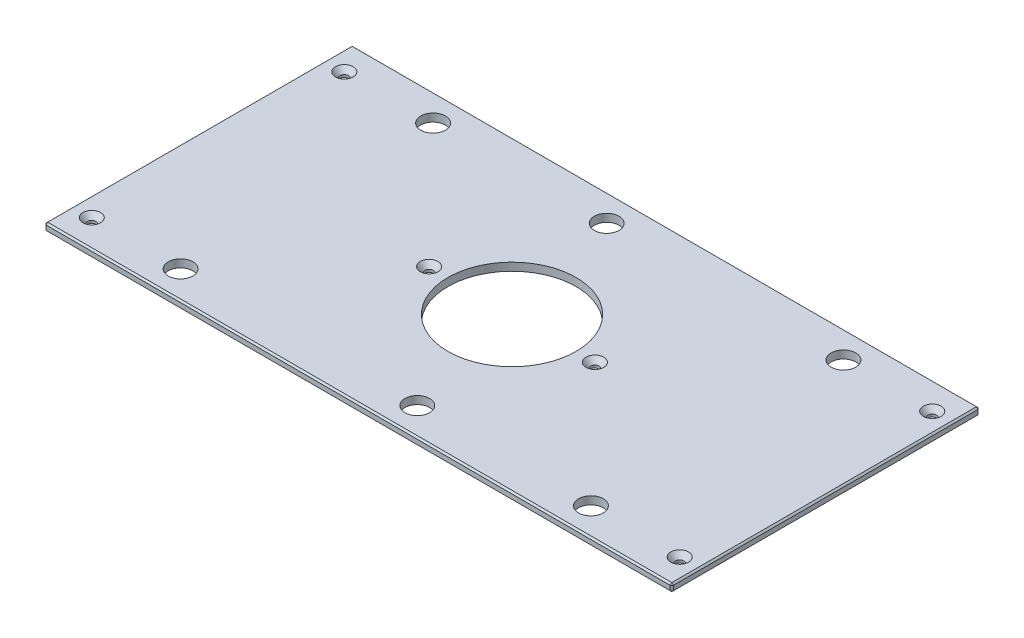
ISO-10303-21;
HEADER;
FILE_DESCRIPTION(('STEP AP214'),'2;1');
FILE_NAME('part.step','',(''),(''),'','','');
FILE_SCHEMA(('AUTOMOTIVE_DESIGN { 1 0 10303 214 1 1 1 1 }'));
ENDSEC;
DATA;
#1=APPLICATION_CONTEXT('core data for automotive mechanical design processes');
#2=APPLICATION_PROTOCOL_DEFINITION('international standard','automotive_design',2000,#1);
#3=PRODUCT_CONTEXT('',#1,'mechanical');
#4=PRODUCT('Part','Part','',(#3));
#5=PRODUCT_RELATED_PRODUCT_CATEGORY('part','',(#4));
#6=PRODUCT_DEFINITION_FORMATION('','',#4);
#7=PRODUCT_DEFINITION_CONTEXT('part definition',#1,'design');
#8=PRODUCT_DEFINITION('design','',#6,#7);
#9=PRODUCT_DEFINITION_SHAPE('','',#8);
#10=(LENGTH_UNIT() NAMED_UNIT(*) SI_UNIT(.MILLI.,.METRE.));
#11=(NAMED_UNIT(*) PLANE_ANGLE_UNIT() SI_UNIT($,.RADIAN.));
#12=(NAMED_UNIT(*) SI_UNIT($,.STERADIAN.) SOLID_ANGLE_UNIT());
#13=UNCERTAINTY_MEASURE_WITH_UNIT(LENGTH_MEASURE(1.E-05),#10,'distance_accuracy_value','');
#14=(GEOMETRIC_REPRESENTATION_CONTEXT(3) GLOBAL_UNCERTAINTY_ASSIGNED_CONTEXT((#13)) GLOBAL_UNIT_ASSIGNED_CONTEXT((#10,
#11,#12)) REPRESENTATION_CONTEXT('',''));
#15=CARTESIAN_POINT('',(0.,0.,0.));
#16=DIRECTION('',(0.,0.,1.));
#17=DIRECTION('',(1.,0.,0.));
#18=AXIS2_PLACEMENT_3D('',#15,#16,#17);
#19=CARTESIAN_POINT('',(-252.4125,6.35,-123.825));
#20=DIRECTION('',(1.,0.,0.));
#21=DIRECTION('',(0.,0.,-1.));
#22=AXIS2_PLACEMENT_3D('',#19,#20,#21);
#23=PLANE('',#22);
#24=DIRECTION('',(0.,0.,-1.));
#25=VECTOR('',#24,1.);
#26=CARTESIAN_POINT('',(-252.4125,5.07999999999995,-123.825));
#27=LINE('',#26,#25);
#28=CARTESIAN_POINT('',(-252.4125,5.07999999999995,122.555));
#29=VERTEX_POINT('',#28);
#30=CARTESIAN_POINT('',(-252.4125,5.07999999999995,-122.555));
#31=VERTEX_POINT('',#30);
#32=EDGE_CURVE('E134',#29,#31,#27,.T.);
#33=ORIENTED_EDGE('',*,*,#32,.T.);
#34=DIRECTION('',(0.,-1.,0.));
#35=VECTOR('',#34,1.);
#36=CARTESIAN_POINT('',(-252.4125,6.35,-122.555));
#37=LINE('',#36,#35);
#38=CARTESIAN_POINT('',(-252.4125,1.27000000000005,-122.555));
#39=VERTEX_POINT('',#38);
#40=EDGE_CURVE('E130',#31,#39,#37,.T.);
#41=ORIENTED_EDGE('',*,*,#40,.T.);
#42=DIRECTION('',(0.,0.,1.));
#43=VECTOR('',#42,1.);
#44=CARTESIAN_POINT('',(-252.4125,1.27000000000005,-123.825));
#45=LINE('',#44,#43);
#46=CARTESIAN_POINT('',(-252.4125,1.27000000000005,122.555));
#47=VERTEX_POINT('',#46);
#48=EDGE_CURVE('E125',#39,#47,#45,.T.);
#49=ORIENTED_EDGE('',*,*,#48,.T.);
#50=DIRECTION('',(0.,1.,0.));
#51=VECTOR('',#50,1.);
#52=CARTESIAN_POINT('',(-252.4125,6.35,122.555));
#53=LINE('',#52,#51);
#54=EDGE_CURVE('E127',#47,#29,#53,.T.);
#55=ORIENTED_EDGE('',*,*,#54,.T.);
#56=EDGE_LOOP('',(#33,#41,#49,#55));
#57=FACE_BOUND('',#56,.T.);
#58=ADVANCED_FACE('F34',(#57),#23,.F.);
#59=CARTESIAN_POINT('',(-252.4125,6.35,123.825));
#60=DIRECTION('',(0.,0.,-1.));
#61=DIRECTION('',(-1.,0.,0.));
#62=AXIS2_PLACEMENT_3D('',#59,#60,#61);
#63=PLANE('',#62);
#64=DIRECTION('',(1.,0.,0.));
#65=VECTOR('',#64,1.);
#66=CARTESIAN_POINT('',(-252.4125,1.27000000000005,123.825));
#67=LINE('',#66,#65);
#68=CARTESIAN_POINT('',(-251.1425,1.27000000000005,123.825));
#69=VERTEX_POINT('',#68);
#70=CARTESIAN_POINT('',(251.1425,1.27000000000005,123.825));
#71=VERTEX_POINT('',#70);
#72=EDGE_CURVE('E57',#69,#71,#67,.T.);
#73=ORIENTED_EDGE('',*,*,#72,.T.);
#74=DIRECTION('',(0.,1.,0.));
#75=VECTOR('',#74,1.);
#76=CARTESIAN_POINT('',(251.1425,6.35,123.825));
#77=LINE('',#76,#75);
#78=CARTESIAN_POINT('',(251.1425,5.07999999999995,123.825));
#79=VERTEX_POINT('',#78);
#80=EDGE_CURVE('E11',#71,#79,#77,.T.);
#81=ORIENTED_EDGE('',*,*,#80,.T.);
#82=DIRECTION('',(-1.,0.,0.));
#83=VECTOR('',#82,1.);
#84=CARTESIAN_POINT('',(-252.4125,5.07999999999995,123.825));
#85=LINE('',#84,#83);
#86=CARTESIAN_POINT('',(-251.1425,5.07999999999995,123.825));
#87=VERTEX_POINT('',#86);
#88=EDGE_CURVE('E43',#79,#87,#85,.T.);
#89=ORIENTED_EDGE('',*,*,#88,.T.);
#90=DIRECTION('',(0.,-1.,0.));
#91=VECTOR('',#90,1.);
#92=CARTESIAN_POINT('',(-251.1425,6.35,123.825));
#93=LINE('',#92,#91);
#94=EDGE_CURVE('E290',#87,#69,#93,.T.);
#95=ORIENTED_EDGE('',*,*,#94,.T.);
#96=EDGE_LOOP('',(#73,#81,#89,#95));
#97=FACE_BOUND('',#96,.T.);
#98=ADVANCED_FACE('F359',(#97),#63,.F.);
#99=CARTESIAN_POINT('',(252.4125,6.35,-123.825));
#100=DIRECTION('',(-1.,0.,0.));
#101=DIRECTION('',(0.,0.,1.));
#102=AXIS2_PLACEMENT_3D('',#99,#100,#101);
#103=PLANE('',#102);
#104=DIRECTION('',(0.,0.,-1.));
#105=VECTOR('',#104,1.);
#106=CARTESIAN_POINT('',(252.4125,1.27000000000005,-123.825));
#107=LINE('',#106,#105);
#108=CARTESIAN_POINT('',(252.4125,1.27000000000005,122.555));
#109=VERTEX_POINT('',#108);
#110=CARTESIAN_POINT('',(252.4125,1.27000000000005,-122.555));
#111=VERTEX_POINT('',#110);
#112=EDGE_CURVE('E285',#109,#111,#107,.T.);
#113=ORIENTED_EDGE('',*,*,#112,.T.);
#114=DIRECTION('',(0.,1.,0.));
#115=VECTOR('',#114,1.);
#116=CARTESIAN_POINT('',(252.4125,6.35,-122.555));
#117=LINE('',#116,#115);
#118=CARTESIAN_POINT('',(252.4125,5.07999999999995,-122.555));
#119=VERTEX_POINT('',#118);
#120=EDGE_CURVE('E287',#111,#119,#117,.T.);
#121=ORIENTED_EDGE('',*,*,#120,.T.);
#122=DIRECTION('',(0.,0.,1.));
#123=VECTOR('',#122,1.);
#124=CARTESIAN_POINT('',(252.4125,5.07999999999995,123.825));
#125=LINE('',#124,#123);
#126=CARTESIAN_POINT('',(252.4125,5.07999999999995,122.555));
#127=VERTEX_POINT('',#126);
#128=EDGE_CURVE('E283',#119,#127,#125,.T.);
#129=ORIENTED_EDGE('',*,*,#128,.T.);
#130=DIRECTION('',(0.,-1.,0.));
#131=VECTOR('',#130,1.);
#132=CARTESIAN_POINT('',(252.4125,6.35,122.555));
#133=LINE('',#132,#131);
#134=EDGE_CURVE('E281',#127,#109,#133,.T.);
#135=ORIENTED_EDGE('',*,*,#134,.T.);
#136=EDGE_LOOP('',(#113,#121,#129,#135));
#137=FACE_BOUND('',#136,.T.);
#138=ADVANCED_FACE('F346',(#137),#103,.F.);
#139=CARTESIAN_POINT('',(-252.4125,6.35,-123.825));
#140=DIRECTION('',(0.,0.,1.));
#141=DIRECTION('',(1.,0.,0.));
#142=AXIS2_PLACEMENT_3D('',#139,#140,#141);
#143=PLANE('',#142);
#144=DIRECTION('',(-1.,0.,0.));
#145=VECTOR('',#144,1.);
#146=CARTESIAN_POINT('',(-252.4125,1.27000000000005,-123.825));
#147=LINE('',#146,#145);
#148=CARTESIAN_POINT('',(251.1425,1.27000000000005,-123.825));
#149=VERTEX_POINT('',#148);
#150=CARTESIAN_POINT('',(-251.1425,1.27000000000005,-123.825));
#151=VERTEX_POINT('',#150);
#152=EDGE_CURVE('E257',#149,#151,#147,.T.);
#153=ORIENTED_EDGE('',*,*,#152,.T.);
#154=DIRECTION('',(0.,1.,0.));
#155=VECTOR('',#154,1.);
#156=CARTESIAN_POINT('',(-251.1425,6.35,-123.825));
#157=LINE('',#156,#155);
#158=CARTESIAN_POINT('',(-251.1425,5.07999999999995,-123.825));
#159=VERTEX_POINT('',#158);
#160=EDGE_CURVE('E261',#151,#159,#157,.T.);
#161=ORIENTED_EDGE('',*,*,#160,.T.);
#162=DIRECTION('',(1.,0.,0.));
#163=VECTOR('',#162,1.);
#164=CARTESIAN_POINT('',(252.4125,5.07999999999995,-123.825));
#165=LINE('',#164,#163);
#166=CARTESIAN_POINT('',(251.1425,5.07999999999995,-123.825));
#167=VERTEX_POINT('',#166);
#168=EDGE_CURVE('E259',#159,#167,#165,.T.);
#169=ORIENTED_EDGE('',*,*,#168,.T.);
#170=DIRECTION('',(0.,-1.,0.));
#171=VECTOR('',#170,1.);
#172=CARTESIAN_POINT('',(251.1425,6.35,-123.825));
#173=LINE('',#172,#171);
#174=EDGE_CURVE('E255',#167,#149,#173,.T.);
#175=ORIENTED_EDGE('',*,*,#174,.T.);
#176=EDGE_LOOP('',(#153,#161,#169,#175));
#177=FACE_BOUND('',#176,.T.);
#178=ADVANCED_FACE('F320',(#177),#143,.F.);
#179=CARTESIAN_POINT('',(0.,6.35,0.));
#180=DIRECTION('',(0.,1.,0.));
#181=DIRECTION('',(0.,0.,1.));
#182=AXIS2_PLACEMENT_3D('',#179,#180,#181);
#183=PLANE('',#182);
#184=CARTESIAN_POINT('',(236.5375,6.35,-101.6));
#185=DIRECTION('',(0.,1.,0.));
#186=DIRECTION('',(0.,0.,1.));
#187=AXIS2_PLACEMENT_3D('',#184,#185,#186);
#188=CIRCLE('',#187,7.13739999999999);
#189=CARTESIAN_POINT('',(236.5375,6.35,-94.4626));
#190=VERTEX_POINT('',#189);
#191=EDGE_CURVE('E783',#190,#190,#188,.T.);
#192=ORIENTED_EDGE('',*,*,#191,.F.);
#193=EDGE_LOOP('',(#192));
#194=FACE_BOUND('',#193,.T.);
#195=CARTESIAN_POINT('',(236.5375,6.35,101.6));
#196=DIRECTION('',(0.,1.,0.));
#197=DIRECTION('',(0.,0.,1.));
#198=AXIS2_PLACEMENT_3D('',#195,#196,#197);
#199=CIRCLE('',#198,7.13739999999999);
#200=CARTESIAN_POINT('',(236.5375,6.35,108.7374));
#201=VERTEX_POINT('',#200);
#202=EDGE_CURVE('E787',#201,#201,#199,.T.);
#203=ORIENTED_EDGE('',*,*,#202,.F.);
#204=EDGE_LOOP('',(#203));
#205=FACE_BOUND('',#204,.T.);
#206=CARTESIAN_POINT('',(-236.5375,6.35,101.6));
#207=DIRECTION('',(0.,1.,0.));
#208=DIRECTION('',(0.,0.,1.));
#209=AXIS2_PLACEMENT_3D('',#206,#207,#208);
#210=CIRCLE('',#209,7.13739999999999);
#211=CARTESIAN_POINT('',(-236.5375,6.35,108.7374));
#212=VERTEX_POINT('',#211);
#213=EDGE_CURVE('E791',#212,#212,#210,.T.);
#214=ORIENTED_EDGE('',*,*,#213,.F.);
#215=EDGE_LOOP('',(#214));
#216=FACE_BOUND('',#215,.T.);
#217=CARTESIAN_POINT('',(-66.675,6.35,0.));
#218=DIRECTION('',(0.,1.,0.));
#219=DIRECTION('',(0.,0.,1.));
#220=AXIS2_PLACEMENT_3D('',#217,#218,#219);
#221=CIRCLE('',#220,7.1374);
#222=CARTESIAN_POINT('',(-66.675,6.35,7.1374));
#223=VERTEX_POINT('',#222);
#224=EDGE_CURVE('E795',#223,#223,#221,.T.);
#225=ORIENTED_EDGE('',*,*,#224,.F.);
#226=EDGE_LOOP('',(#225));
#227=FACE_BOUND('',#226,.T.);
#228=CARTESIAN_POINT('',(66.675,6.35,0.));
#229=DIRECTION('',(0.,1.,0.));
#230=DIRECTION('',(0.,0.,1.));
#231=AXIS2_PLACEMENT_3D('',#228,#229,#230);
#232=CIRCLE('',#231,7.1374);
#233=CARTESIAN_POINT('',(66.675,6.35,7.1374));
#234=VERTEX_POINT('',#233);
#235=EDGE_CURVE('E799',#234,#234,#232,.T.);
#236=ORIENTED_EDGE('',*,*,#235,.F.);
#237=EDGE_LOOP('',(#236));
#238=FACE_BOUND('',#237,.T.);
#239=CARTESIAN_POINT('',(-236.5375,6.35,-101.6));
#240=DIRECTION('',(0.,1.,0.));
#241=DIRECTION('',(0.,0.,1.));
#242=AXIS2_PLACEMENT_3D('',#239,#240,#241);
#243=CIRCLE('',#242,7.13739999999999);
#244=CARTESIAN_POINT('',(-236.5375,6.35,-94.4626));
#245=VERTEX_POINT('',#244);
#246=EDGE_CURVE('E802',#245,#245,#243,.T.);
#247=ORIENTED_EDGE('',*,*,#246,.F.);
#248=EDGE_LOOP('',(#247));
#249=FACE_BOUND('',#248,.T.);
#250=DIRECTION('',(0.,0.,-1.));
#251=VECTOR('',#250,1.);
#252=CARTESIAN_POINT('',(251.1425,6.35,-123.825));
#253=LINE('',#252,#251);
#254=CARTESIAN_POINT('',(251.1425,6.35,122.555));
#255=VERTEX_POINT('',#254);
#256=CARTESIAN_POINT('',(251.1425,6.35,-122.555));
#257=VERTEX_POINT('',#256);
#258=EDGE_CURVE('E268',#255,#257,#253,.T.);
#259=ORIENTED_EDGE('',*,*,#258,.T.);
#260=DIRECTION('',(-1.,0.,0.));
#261=VECTOR('',#260,1.);
#262=CARTESIAN_POINT('',(-252.4125,6.35,-122.555));
#263=LINE('',#262,#261);
#264=CARTESIAN_POINT('',(-251.1425,6.35,-122.555));
#265=VERTEX_POINT('',#264);
#266=EDGE_CURVE('E270',#257,#265,#263,.T.);
#267=ORIENTED_EDGE('',*,*,#266,.T.);
#268=DIRECTION('',(0.,0.,1.));
#269=VECTOR('',#268,1.);
#270=CARTESIAN_POINT('',(-251.1425,6.35,123.825));
#271=LINE('',#270,#269);
#272=CARTESIAN_POINT('',(-251.1425,6.35,122.555));
#273=VERTEX_POINT('',#272);
#274=EDGE_CURVE('E266',#265,#273,#271,.T.);
#275=ORIENTED_EDGE('',*,*,#274,.T.);
#276=DIRECTION('',(1.,0.,0.));
#277=VECTOR('',#276,1.);
#278=CARTESIAN_POINT('',(252.4125,6.35,122.555));
#279=LINE('',#278,#277);
#280=EDGE_CURVE('E264',#273,#255,#279,.T.);
#281=ORIENTED_EDGE('',*,*,#280,.T.);
#282=EDGE_LOOP('',(#259,#267,#275,#281));
#283=FACE_BOUND('',#282,.T.);
#284=CARTESIAN_POINT('',(165.1,6.35,-101.6));
#285=DIRECTION('',(0.,1.,0.));
#286=DIRECTION('',(0.,0.,1.));
#287=AXIS2_PLACEMENT_3D('',#284,#285,#286);
#288=CIRCLE('',#287,9.921875);
#289=CARTESIAN_POINT('',(165.1,6.35,-91.678125));
#290=VERTEX_POINT('',#289);
#291=EDGE_CURVE('E203',#290,#290,#288,.T.);
#292=ORIENTED_EDGE('',*,*,#291,.F.);
#293=EDGE_LOOP('',(#292));
#294=FACE_BOUND('',#293,.T.);
#295=CARTESIAN_POINT('',(-165.1,6.35,-101.6));
#296=DIRECTION('',(0.,1.,0.));
#297=DIRECTION('',(0.,0.,1.));
#298=AXIS2_PLACEMENT_3D('',#295,#296,#297);
#299=CIRCLE('',#298,9.921875);
#300=CARTESIAN_POINT('',(-165.1,6.35,-91.678125));
#301=VERTEX_POINT('',#300);
#302=EDGE_CURVE('E213',#301,#301,#299,.T.);
#303=ORIENTED_EDGE('',*,*,#302,.F.);
#304=EDGE_LOOP('',(#303));
#305=FACE_BOUND('',#304,.T.);
#306=CARTESIAN_POINT('',(165.1,6.35,101.6));
#307=DIRECTION('',(0.,1.,0.));
#308=DIRECTION('',(0.,0.,1.));
#309=AXIS2_PLACEMENT_3D('',#306,#307,#308);
#310=CIRCLE('',#309,9.921875);
#311=CARTESIAN_POINT('',(165.1,6.35,111.521875));
#312=VERTEX_POINT('',#311);
#313=EDGE_CURVE('E224',#312,#312,#310,.T.);
#314=ORIENTED_EDGE('',*,*,#313,.F.);
#315=EDGE_LOOP('',(#314));
#316=FACE_BOUND('',#315,.T.);
#317=CARTESIAN_POINT('',(-165.1,6.35,101.6));
#318=DIRECTION('',(0.,1.,0.));
#319=DIRECTION('',(0.,0.,1.));
#320=AXIS2_PLACEMENT_3D('',#317,#318,#319);
#321=CIRCLE('',#320,9.921875);
#322=CARTESIAN_POINT('',(-165.1,6.35,111.521875));
#323=VERTEX_POINT('',#322);
#324=EDGE_CURVE('E230',#323,#323,#321,.T.);
#325=ORIENTED_EDGE('',*,*,#324,.F.);
#326=EDGE_LOOP('',(#325));
#327=FACE_BOUND('',#326,.T.);
#328=CARTESIAN_POINT('',(-25.4,6.35,-101.6));
#329=DIRECTION('',(0.,1.,0.));
#330=DIRECTION('',(0.,0.,1.));
#331=AXIS2_PLACEMENT_3D('',#328,#329,#330);
#332=CIRCLE('',#331,9.921875);
#333=CARTESIAN_POINT('',(-25.4,6.35,-91.678125));
#334=VERTEX_POINT('',#333);
#335=EDGE_CURVE('E236',#334,#334,#332,.T.);
#336=ORIENTED_EDGE('',*,*,#335,.F.);
#337=EDGE_LOOP('',(#336));
#338=FACE_BOUND('',#337,.T.);
#339=CARTESIAN_POINT('',(25.4,6.35,101.6));
#340=DIRECTION('',(0.,1.,0.));
#341=DIRECTION('',(0.,0.,1.));
#342=AXIS2_PLACEMENT_3D('',#339,#340,#341);
#343=CIRCLE('',#342,9.921875);
#344=CARTESIAN_POINT('',(25.4,6.35,111.521875));
#345=VERTEX_POINT('',#344);
#346=EDGE_CURVE('E242',#345,#345,#343,.T.);
#347=ORIENTED_EDGE('',*,*,#346,.F.);
#348=EDGE_LOOP('',(#347));
#349=FACE_BOUND('',#348,.T.);
#350=CARTESIAN_POINT('',(0.,6.35,0.));
#351=DIRECTION('',(0.,1.,0.));
#352=DIRECTION('',(0.,0.,1.));
#353=AXIS2_PLACEMENT_3D('',#350,#351,#352);
#354=CIRCLE('',#353,51.562);
#355=CARTESIAN_POINT('',(0.,6.35,51.562));
#356=VERTEX_POINT('',#355);
#357=EDGE_CURVE('E248',#356,#356,#354,.T.);
#358=ORIENTED_EDGE('',*,*,#357,.F.);
#359=EDGE_LOOP('',(#358));
#360=FACE_BOUND('',#359,.T.);
#361=ADVANCED_FACE('F368',(#194,#205,#216,#227,#238,#249,#283,#294,#305,#316,#327,#338,#349,
#360),#183,.T.);
#362=CARTESIAN_POINT('',(0.,0.,0.));
#363=DIRECTION('',(0.,1.,0.));
#364=DIRECTION('',(0.,0.,1.));
#365=AXIS2_PLACEMENT_3D('',#362,#363,#364);
#366=PLANE('',#365);
#367=CARTESIAN_POINT('',(236.5375,0.,-101.6));
#368=DIRECTION('',(0.,1.,0.));
#369=DIRECTION('',(0.,0.,1.));
#370=AXIS2_PLACEMENT_3D('',#367,#368,#369);
#371=CIRCLE('',#370,3.3782);
#372=CARTESIAN_POINT('',(236.5375,0.,-98.2218));
#373=VERTEX_POINT('',#372);
#374=EDGE_CURVE('E836',#373,#373,#371,.T.);
#375=ORIENTED_EDGE('',*,*,#374,.T.);
#376=EDGE_LOOP('',(#375));
#377=FACE_BOUND('',#376,.T.);
#378=CARTESIAN_POINT('',(236.5375,0.,101.6));
#379=DIRECTION('',(0.,1.,0.));
#380=DIRECTION('',(0.,0.,1.));
#381=AXIS2_PLACEMENT_3D('',#378,#379,#380);
#382=CIRCLE('',#381,3.3782);
#383=CARTESIAN_POINT('',(236.5375,0.,104.9782));
#384=VERTEX_POINT('',#383);
#385=EDGE_CURVE('E829',#384,#384,#382,.T.);
#386=ORIENTED_EDGE('',*,*,#385,.T.);
#387=EDGE_LOOP('',(#386));
#388=FACE_BOUND('',#387,.T.);
#389=CARTESIAN_POINT('',(-236.5375,0.,101.6));
#390=DIRECTION('',(0.,1.,0.));
#391=DIRECTION('',(0.,0.,1.));
#392=AXIS2_PLACEMENT_3D('',#389,#390,#391);
#393=CIRCLE('',#392,3.3782);
#394=CARTESIAN_POINT('',(-236.5375,0.,104.9782));
#395=VERTEX_POINT('',#394);
#396=EDGE_CURVE('E822',#395,#395,#393,.T.);
#397=ORIENTED_EDGE('',*,*,#396,.T.);
#398=EDGE_LOOP('',(#397));
#399=FACE_BOUND('',#398,.T.);
#400=CARTESIAN_POINT('',(-66.675,0.,0.));
#401=DIRECTION('',(0.,1.,0.));
#402=DIRECTION('',(0.,0.,1.));
#403=AXIS2_PLACEMENT_3D('',#400,#401,#402);
#404=CIRCLE('',#403,3.3782);
#405=CARTESIAN_POINT('',(-66.675,0.,3.3782));
#406=VERTEX_POINT('',#405);
#407=EDGE_CURVE('E815',#406,#406,#404,.T.);
#408=ORIENTED_EDGE('',*,*,#407,.T.);
#409=EDGE_LOOP('',(#408));
#410=FACE_BOUND('',#409,.T.);
#411=CARTESIAN_POINT('',(66.675,0.,0.));
#412=DIRECTION('',(0.,1.,0.));
#413=DIRECTION('',(0.,0.,1.));
#414=AXIS2_PLACEMENT_3D('',#411,#412,#413);
#415=CIRCLE('',#414,3.3782);
#416=CARTESIAN_POINT('',(66.675,0.,3.3782));
#417=VERTEX_POINT('',#416);
#418=EDGE_CURVE('E805',#417,#417,#415,.T.);
#419=ORIENTED_EDGE('',*,*,#418,.T.);
#420=EDGE_LOOP('',(#419));
#421=FACE_BOUND('',#420,.T.);
#422=CARTESIAN_POINT('',(-236.5375,0.,-101.6));
#423=DIRECTION('',(0.,1.,0.));
#424=DIRECTION('',(0.,0.,1.));
#425=AXIS2_PLACEMENT_3D('',#422,#423,#424);
#426=CIRCLE('',#425,3.3782);
#427=CARTESIAN_POINT('',(-236.5375,0.,-98.2218));
#428=VERTEX_POINT('',#427);
#429=EDGE_CURVE('E216',#428,#428,#426,.T.);
#430=ORIENTED_EDGE('',*,*,#429,.T.);
#431=EDGE_LOOP('',(#430));
#432=FACE_BOUND('',#431,.T.);
#433=DIRECTION('',(0.,0.,-1.));
#434=VECTOR('',#433,1.);
#435=CARTESIAN_POINT('',(-251.1425,0.,0.));
#436=LINE('',#435,#434);
#437=CARTESIAN_POINT('',(-251.1425,0.,122.555));
#438=VERTEX_POINT('',#437);
#439=CARTESIAN_POINT('',(-251.1425,0.,-122.555));
#440=VERTEX_POINT('',#439);
#441=EDGE_CURVE('E157',#438,#440,#436,.T.);
#442=ORIENTED_EDGE('',*,*,#441,.T.);
#443=DIRECTION('',(1.,0.,0.));
#444=VECTOR('',#443,1.);
#445=CARTESIAN_POINT('',(0.,0.,-122.555));
#446=LINE('',#445,#444);
#447=CARTESIAN_POINT('',(251.1425,0.,-122.555));
#448=VERTEX_POINT('',#447);
#449=EDGE_CURVE('E278',#440,#448,#446,.T.);
#450=ORIENTED_EDGE('',*,*,#449,.T.);
#451=DIRECTION('',(0.,0.,1.));
#452=VECTOR('',#451,1.);
#453=CARTESIAN_POINT('',(251.1425,0.,0.));
#454=LINE('',#453,#452);
#455=CARTESIAN_POINT('',(251.1425,0.,122.555));
#456=VERTEX_POINT('',#455);
#457=EDGE_CURVE('E276',#448,#456,#454,.T.);
#458=ORIENTED_EDGE('',*,*,#457,.T.);
#459=DIRECTION('',(-1.,0.,0.));
#460=VECTOR('',#459,1.);
#461=CARTESIAN_POINT('',(0.,0.,122.555));
#462=LINE('',#461,#460);
#463=EDGE_CURVE('E273',#456,#438,#462,.T.);
#464=ORIENTED_EDGE('',*,*,#463,.T.);
#465=EDGE_LOOP('',(#442,#450,#458,#464));
#466=FACE_BOUND('',#465,.T.);
#467=CARTESIAN_POINT('',(165.1,0.,-101.6));
#468=DIRECTION('',(0.,1.,0.));
#469=DIRECTION('',(0.,0.,1.));
#470=AXIS2_PLACEMENT_3D('',#467,#468,#469);
#471=CIRCLE('',#470,9.921875);
#472=CARTESIAN_POINT('',(165.1,0.,-91.678125));
#473=VERTEX_POINT('',#472);
#474=EDGE_CURVE('E208',#473,#473,#471,.T.);
#475=ORIENTED_EDGE('',*,*,#474,.T.);
#476=EDGE_LOOP('',(#475));
#477=FACE_BOUND('',#476,.T.);
#478=CARTESIAN_POINT('',(-165.1,0.,-101.6));
#479=DIRECTION('',(0.,1.,0.));
#480=DIRECTION('',(0.,0.,1.));
#481=AXIS2_PLACEMENT_3D('',#478,#479,#480);
#482=CIRCLE('',#481,9.921875);
#483=CARTESIAN_POINT('',(-165.1,0.,-91.678125));
#484=VERTEX_POINT('',#483);
#485=EDGE_CURVE('E221',#484,#484,#482,.T.);
#486=ORIENTED_EDGE('',*,*,#485,.T.);
#487=EDGE_LOOP('',(#486));
#488=FACE_BOUND('',#487,.T.);
#489=CARTESIAN_POINT('',(165.1,0.,101.6));
#490=DIRECTION('',(0.,1.,0.));
#491=DIRECTION('',(0.,0.,1.));
#492=AXIS2_PLACEMENT_3D('',#489,#490,#491);
#493=CIRCLE('',#492,9.921875);
#494=CARTESIAN_POINT('',(165.1,0.,111.521875));
#495=VERTEX_POINT('',#494);
#496=EDGE_CURVE('E227',#495,#495,#493,.T.);
#497=ORIENTED_EDGE('',*,*,#496,.T.);
#498=EDGE_LOOP('',(#497));
#499=FACE_BOUND('',#498,.T.);
#500=CARTESIAN_POINT('',(-165.1,0.,101.6));
#501=DIRECTION('',(0.,1.,0.));
#502=DIRECTION('',(0.,0.,1.));
#503=AXIS2_PLACEMENT_3D('',#500,#501,#502);
#504=CIRCLE('',#503,9.921875);
#505=CARTESIAN_POINT('',(-165.1,0.,111.521875));
#506=VERTEX_POINT('',#505);
#507=EDGE_CURVE('E233',#506,#506,#504,.T.);
#508=ORIENTED_EDGE('',*,*,#507,.T.);
#509=EDGE_LOOP('',(#508));
#510=FACE_BOUND('',#509,.T.);
#511=CARTESIAN_POINT('',(-25.4,0.,-101.6));
#512=DIRECTION('',(0.,1.,0.));
#513=DIRECTION('',(0.,0.,1.));
#514=AXIS2_PLACEMENT_3D('',#511,#512,#513);
#515=CIRCLE('',#514,9.921875);
#516=CARTESIAN_POINT('',(-25.4,0.,-91.678125));
#517=VERTEX_POINT('',#516);
#518=EDGE_CURVE('E239',#517,#517,#515,.T.);
#519=ORIENTED_EDGE('',*,*,#518,.T.);
#520=EDGE_LOOP('',(#519));
#521=FACE_BOUND('',#520,.T.);
#522=CARTESIAN_POINT('',(25.4,0.,101.6));
#523=DIRECTION('',(0.,1.,0.));
#524=DIRECTION('',(0.,0.,1.));
#525=AXIS2_PLACEMENT_3D('',#522,#523,#524);
#526=CIRCLE('',#525,9.921875);
#527=CARTESIAN_POINT('',(25.4,0.,111.521875));
#528=VERTEX_POINT('',#527);
#529=EDGE_CURVE('E245',#528,#528,#526,.T.);
#530=ORIENTED_EDGE('',*,*,#529,.T.);
#531=EDGE_LOOP('',(#530));
#532=FACE_BOUND('',#531,.T.);
#533=CARTESIAN_POINT('',(0.,0.,0.));
#534=DIRECTION('',(0.,1.,0.));
#535=DIRECTION('',(0.,0.,1.));
#536=AXIS2_PLACEMENT_3D('',#533,#534,#535);
#537=CIRCLE('',#536,51.562);
#538=CARTESIAN_POINT('',(0.,0.,51.562));
#539=VERTEX_POINT('',#538);
#540=EDGE_CURVE('E146',#539,#539,#537,.T.);
#541=ORIENTED_EDGE('',*,*,#540,.T.);
#542=EDGE_LOOP('',(#541));
#543=FACE_BOUND('',#542,.T.);
#544=ADVANCED_FACE('F333',(#377,#388,#399,#410,#421,#432,#466,#477,#488,#499,#510,#521,#532,
#543),#366,.F.);
#545=CARTESIAN_POINT('',(0.,0.,0.));
#546=DIRECTION('',(0.,1.,0.));
#547=DIRECTION('',(0.,0.,1.));
#548=AXIS2_PLACEMENT_3D('',#545,#546,#547);
#549=CYLINDRICAL_SURFACE('',#548,51.562);
#550=ORIENTED_EDGE('',*,*,#540,.F.);
#551=EDGE_LOOP('',(#550));
#552=FACE_BOUND('',#551,.T.);
#553=ORIENTED_EDGE('',*,*,#357,.T.);
#554=EDGE_LOOP('',(#553));
#555=FACE_BOUND('',#554,.T.);
#556=ADVANCED_FACE('F720',(#552,#555),#549,.F.);
#557=CARTESIAN_POINT('',(25.4,6.35,101.6));
#558=DIRECTION('',(0.,1.,0.));
#559=DIRECTION('',(0.,0.,1.));
#560=AXIS2_PLACEMENT_3D('',#557,#558,#559);
#561=CYLINDRICAL_SURFACE('',#560,9.921875);
#562=ORIENTED_EDGE('',*,*,#529,.F.);
#563=EDGE_LOOP('',(#562));
#564=FACE_BOUND('',#563,.T.);
#565=ORIENTED_EDGE('',*,*,#346,.T.);
#566=EDGE_LOOP('',(#565));
#567=FACE_BOUND('',#566,.T.);
#568=ADVANCED_FACE('F711',(#564,#567),#561,.F.);
#569=CARTESIAN_POINT('',(-25.4,6.35,-101.6));
#570=DIRECTION('',(0.,1.,0.));
#571=DIRECTION('',(0.,0.,1.));
#572=AXIS2_PLACEMENT_3D('',#569,#570,#571);
#573=CYLINDRICAL_SURFACE('',#572,9.921875);
#574=ORIENTED_EDGE('',*,*,#518,.F.);
#575=EDGE_LOOP('',(#574));
#576=FACE_BOUND('',#575,.T.);
#577=ORIENTED_EDGE('',*,*,#335,.T.);
#578=EDGE_LOOP('',(#577));
#579=FACE_BOUND('',#578,.T.);
#580=ADVANCED_FACE('F702',(#576,#579),#573,.F.);
#581=CARTESIAN_POINT('',(-165.1,6.35,101.6));
#582=DIRECTION('',(0.,1.,0.));
#583=DIRECTION('',(0.,0.,1.));
#584=AXIS2_PLACEMENT_3D('',#581,#582,#583);
#585=CYLINDRICAL_SURFACE('',#584,9.921875);
#586=ORIENTED_EDGE('',*,*,#507,.F.);
#587=EDGE_LOOP('',(#586));
#588=FACE_BOUND('',#587,.T.);
#589=ORIENTED_EDGE('',*,*,#324,.T.);
#590=EDGE_LOOP('',(#589));
#591=FACE_BOUND('',#590,.T.);
#592=ADVANCED_FACE('F693',(#588,#591),#585,.F.);
#593=CARTESIAN_POINT('',(165.1,6.35,101.6));
#594=DIRECTION('',(0.,1.,0.));
#595=DIRECTION('',(0.,0.,1.));
#596=AXIS2_PLACEMENT_3D('',#593,#594,#595);
#597=CYLINDRICAL_SURFACE('',#596,9.921875);
#598=ORIENTED_EDGE('',*,*,#496,.F.);
#599=EDGE_LOOP('',(#598));
#600=FACE_BOUND('',#599,.T.);
#601=ORIENTED_EDGE('',*,*,#313,.T.);
#602=EDGE_LOOP('',(#601));
#603=FACE_BOUND('',#602,.T.);
#604=ADVANCED_FACE('F684',(#600,#603),#597,.F.);
#605=CARTESIAN_POINT('',(-165.1,6.35,-101.6));
#606=DIRECTION('',(0.,1.,0.));
#607=DIRECTION('',(0.,0.,1.));
#608=AXIS2_PLACEMENT_3D('',#605,#606,#607);
#609=CYLINDRICAL_SURFACE('',#608,9.921875);
#610=ORIENTED_EDGE('',*,*,#485,.F.);
#611=EDGE_LOOP('',(#610));
#612=FACE_BOUND('',#611,.T.);
#613=ORIENTED_EDGE('',*,*,#302,.T.);
#614=EDGE_LOOP('',(#613));
#615=FACE_BOUND('',#614,.T.);
#616=ADVANCED_FACE('F674',(#612,#615),#609,.F.);
#617=CARTESIAN_POINT('',(165.1,6.35,-101.6));
#618=DIRECTION('',(0.,1.,0.));
#619=DIRECTION('',(0.,0.,1.));
#620=AXIS2_PLACEMENT_3D('',#617,#618,#619);
#621=CYLINDRICAL_SURFACE('',#620,9.921875);
#622=ORIENTED_EDGE('',*,*,#474,.F.);
#623=EDGE_LOOP('',(#622));
#624=FACE_BOUND('',#623,.T.);
#625=ORIENTED_EDGE('',*,*,#291,.T.);
#626=EDGE_LOOP('',(#625));
#627=FACE_BOUND('',#626,.T.);
#628=ADVANCED_FACE('F377',(#624,#627),#621,.F.);
#629=CARTESIAN_POINT('',(252.4125,6.35,122.555));
#630=DIRECTION('',(-0.707106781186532,0.,-0.707106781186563));
#631=DIRECTION('',(0.,-1.,0.));
#632=AXIS2_PLACEMENT_3D('',#629,#630,#631);
#633=PLANE('',#632);
#634=DIRECTION('',(-0.707106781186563,0.,0.707106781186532));
#635=VECTOR('',#634,1.);
#636=CARTESIAN_POINT('',(252.4125,5.07999999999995,122.555));
#637=LINE('',#636,#635);
#638=EDGE_CURVE('E38',#79,#127,#637,.F.);
#639=ORIENTED_EDGE('',*,*,#638,.F.);
#640=ORIENTED_EDGE('',*,*,#80,.F.);
#641=DIRECTION('',(0.707106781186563,0.,-0.707106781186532));
#642=VECTOR('',#641,1.);
#643=CARTESIAN_POINT('',(251.7775,1.27000000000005,123.19));
#644=LINE('',#643,#642);
#645=EDGE_CURVE('E196',#109,#71,#644,.F.);
#646=ORIENTED_EDGE('',*,*,#645,.F.);
#647=ORIENTED_EDGE('',*,*,#134,.F.);
#648=EDGE_LOOP('',(#639,#640,#646,#647));
#649=FACE_BOUND('',#648,.T.);
#650=ADVANCED_FACE('F36',(#649),#633,.F.);
#651=CARTESIAN_POINT('',(252.4125,5.07999999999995,122.555));
#652=DIRECTION('',(0.577350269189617,0.577350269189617,0.577350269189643));
#653=DIRECTION('',(0.707106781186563,0.,-0.707106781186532));
#654=AXIS2_PLACEMENT_3D('',#651,#652,#653);
#655=PLANE('',#654);
#656=DIRECTION('',(0.,-0.707106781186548,0.707106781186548));
#657=VECTOR('',#656,1.);
#658=CARTESIAN_POINT('',(251.1425,5.715,123.19));
#659=LINE('',#658,#657);
#660=EDGE_CURVE('E192',#79,#255,#659,.F.);
#661=ORIENTED_EDGE('',*,*,#660,.F.);
#662=ORIENTED_EDGE('',*,*,#638,.T.);
#663=DIRECTION('',(-0.707106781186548,0.707106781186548,0.));
#664=VECTOR('',#663,1.);
#665=CARTESIAN_POINT('',(252.4125,5.07999999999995,122.555));
#666=LINE('',#665,#664);
#667=EDGE_CURVE('E194',#255,#127,#666,.F.);
#668=ORIENTED_EDGE('',*,*,#667,.F.);
#669=EDGE_LOOP('',(#661,#662,#668));
#670=FACE_BOUND('',#669,.T.);
#671=ADVANCED_FACE('F370',(#670),#655,.T.);
#672=CARTESIAN_POINT('',(251.1425,0.,122.555));
#673=DIRECTION('',(0.577350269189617,-0.577350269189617,0.577350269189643));
#674=DIRECTION('',(0.707106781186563,0.,-0.707106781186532));
#675=AXIS2_PLACEMENT_3D('',#672,#673,#674);
#676=PLANE('',#675);
#677=DIRECTION('',(-0.707106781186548,-0.707106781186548,0.));
#678=VECTOR('',#677,1.);
#679=CARTESIAN_POINT('',(251.1425,0.,122.555));
#680=LINE('',#679,#678);
#681=EDGE_CURVE('E186',#109,#456,#680,.T.);
#682=ORIENTED_EDGE('',*,*,#681,.F.);
#683=ORIENTED_EDGE('',*,*,#645,.T.);
#684=DIRECTION('',(0.,0.707106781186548,0.707106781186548));
#685=VECTOR('',#684,1.);
#686=CARTESIAN_POINT('',(251.1425,0.,122.555));
#687=LINE('',#686,#685);
#688=EDGE_CURVE('E189',#456,#71,#687,.T.);
#689=ORIENTED_EDGE('',*,*,#688,.F.);
#690=EDGE_LOOP('',(#682,#683,#689));
#691=FACE_BOUND('',#690,.T.);
#692=ADVANCED_FACE('F339',(#691),#676,.T.);
#693=CARTESIAN_POINT('',(251.1425,6.35,0.));
#694=DIRECTION('',(0.707106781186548,0.707106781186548,0.));
#695=DIRECTION('',(0.,0.,1.));
#696=AXIS2_PLACEMENT_3D('',#693,#694,#695);
#697=PLANE('',#696);
#698=ORIENTED_EDGE('',*,*,#667,.T.);
#699=ORIENTED_EDGE('',*,*,#128,.F.);
#700=DIRECTION('',(0.707106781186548,-0.707106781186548,0.));
#701=VECTOR('',#700,1.);
#702=CARTESIAN_POINT('',(251.7775,5.715,-122.555));
#703=LINE('',#702,#701);
#704=EDGE_CURVE('E181',#257,#119,#703,.T.);
#705=ORIENTED_EDGE('',*,*,#704,.F.);
#706=ORIENTED_EDGE('',*,*,#258,.F.);
#707=EDGE_LOOP('',(#698,#699,#705,#706));
#708=FACE_BOUND('',#707,.T.);
#709=ADVANCED_FACE('F356',(#708),#697,.T.);
#710=CARTESIAN_POINT('',(0.,6.35,122.555));
#711=DIRECTION('',(0.,0.707106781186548,0.707106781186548));
#712=DIRECTION('',(-1.,0.,0.));
#713=AXIS2_PLACEMENT_3D('',#710,#711,#712);
#714=PLANE('',#713);
#715=ORIENTED_EDGE('',*,*,#660,.T.);
#716=ORIENTED_EDGE('',*,*,#280,.F.);
#717=DIRECTION('',(0.,0.707106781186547,-0.707106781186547));
#718=VECTOR('',#717,1.);
#719=CARTESIAN_POINT('',(-251.1425,6.35,122.555));
#720=LINE('',#719,#718);
#721=EDGE_CURVE('E178',#87,#273,#720,.T.);
#722=ORIENTED_EDGE('',*,*,#721,.F.);
#723=ORIENTED_EDGE('',*,*,#88,.F.);
#724=EDGE_LOOP('',(#715,#716,#722,#723));
#725=FACE_BOUND('',#724,.T.);
#726=ADVANCED_FACE('F361',(#725),#714,.T.);
#727=CARTESIAN_POINT('',(-251.1425,6.35,123.825));
#728=DIRECTION('',(0.707106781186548,0.,-0.707106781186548));
#729=DIRECTION('',(0.,-1.,0.));
#730=AXIS2_PLACEMENT_3D('',#727,#728,#729);
#731=PLANE('',#730);
#732=DIRECTION('',(0.707106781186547,0.,0.707106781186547));
#733=VECTOR('',#732,1.);
#734=CARTESIAN_POINT('',(-252.4125,1.27000000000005,122.555));
#735=LINE('',#734,#733);
#736=EDGE_CURVE('E141',#69,#47,#735,.F.);
#737=ORIENTED_EDGE('',*,*,#736,.F.);
#738=ORIENTED_EDGE('',*,*,#94,.F.);
#739=DIRECTION('',(-0.707106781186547,0.,-0.707106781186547));
#740=VECTOR('',#739,1.);
#741=CARTESIAN_POINT('',(-251.7775,5.07999999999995,123.19));
#742=LINE('',#741,#740);
#743=EDGE_CURVE('E144',#29,#87,#742,.F.);
#744=ORIENTED_EDGE('',*,*,#743,.F.);
#745=ORIENTED_EDGE('',*,*,#54,.F.);
#746=EDGE_LOOP('',(#737,#738,#744,#745));
#747=FACE_BOUND('',#746,.T.);
#748=ADVANCED_FACE('F139',(#747),#731,.F.);
#749=CARTESIAN_POINT('',(-252.4125,1.27000000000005,123.825));
#750=DIRECTION('',(0.,0.707106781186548,-0.707106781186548));
#751=DIRECTION('',(1.,0.,0.));
#752=AXIS2_PLACEMENT_3D('',#749,#750,#751);
#753=PLANE('',#752);
#754=ORIENTED_EDGE('',*,*,#688,.T.);
#755=ORIENTED_EDGE('',*,*,#72,.F.);
#756=DIRECTION('',(0.,-0.707106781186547,-0.707106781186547));
#757=VECTOR('',#756,1.);
#758=CARTESIAN_POINT('',(-251.1425,0.635000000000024,123.19));
#759=LINE('',#758,#757);
#760=EDGE_CURVE('E154',#438,#69,#759,.F.);
#761=ORIENTED_EDGE('',*,*,#760,.F.);
#762=ORIENTED_EDGE('',*,*,#463,.F.);
#763=EDGE_LOOP('',(#754,#755,#761,#762));
#764=FACE_BOUND('',#763,.T.);
#765=ADVANCED_FACE('F338',(#764),#753,.F.);
#766=CARTESIAN_POINT('',(252.4125,1.27000000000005,-123.825));
#767=DIRECTION('',(-0.707106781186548,0.707106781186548,0.));
#768=DIRECTION('',(0.,0.,-1.));
#769=AXIS2_PLACEMENT_3D('',#766,#767,#768);
#770=PLANE('',#769);
#771=ORIENTED_EDGE('',*,*,#681,.T.);
#772=ORIENTED_EDGE('',*,*,#457,.F.);
#773=DIRECTION('',(0.707106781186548,0.707106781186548,0.));
#774=VECTOR('',#773,1.);
#775=CARTESIAN_POINT('',(251.1425,0.,-122.555));
#776=LINE('',#775,#774);
#777=EDGE_CURVE('E173',#111,#448,#776,.F.);
#778=ORIENTED_EDGE('',*,*,#777,.F.);
#779=ORIENTED_EDGE('',*,*,#112,.F.);
#780=EDGE_LOOP('',(#771,#772,#778,#779));
#781=FACE_BOUND('',#780,.T.);
#782=ADVANCED_FACE('F343',(#781),#770,.F.);
#783=CARTESIAN_POINT('',(251.1425,6.35,-123.825));
#784=DIRECTION('',(-0.707106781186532,0.,0.707106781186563));
#785=DIRECTION('',(0.,-1.,0.));
#786=AXIS2_PLACEMENT_3D('',#783,#784,#785);
#787=PLANE('',#786);
#788=DIRECTION('',(0.707106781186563,0.,0.707106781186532));
#789=VECTOR('',#788,1.);
#790=CARTESIAN_POINT('',(251.1425,5.07999999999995,-123.825));
#791=LINE('',#790,#789);
#792=EDGE_CURVE('E183',#119,#167,#791,.F.);
#793=ORIENTED_EDGE('',*,*,#792,.F.);
#794=ORIENTED_EDGE('',*,*,#120,.F.);
#795=DIRECTION('',(-0.707106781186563,0.,-0.707106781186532));
#796=VECTOR('',#795,1.);
#797=CARTESIAN_POINT('',(251.7775,1.27000000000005,-123.19));
#798=LINE('',#797,#796);
#799=EDGE_CURVE('E170',#149,#111,#798,.F.);
#800=ORIENTED_EDGE('',*,*,#799,.F.);
#801=ORIENTED_EDGE('',*,*,#174,.F.);
#802=EDGE_LOOP('',(#793,#794,#800,#801));
#803=FACE_BOUND('',#802,.T.);
#804=ADVANCED_FACE('F351',(#803),#787,.F.);
#805=CARTESIAN_POINT('',(251.1425,5.07999999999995,-123.825));
#806=DIRECTION('',(0.577350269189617,0.577350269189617,-0.577350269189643));
#807=DIRECTION('',(-0.707106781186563,0.,-0.707106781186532));
#808=AXIS2_PLACEMENT_3D('',#805,#806,#807);
#809=PLANE('',#808);
#810=ORIENTED_EDGE('',*,*,#704,.T.);
#811=ORIENTED_EDGE('',*,*,#792,.T.);
#812=DIRECTION('',(0.,0.707106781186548,0.707106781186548));
#813=VECTOR('',#812,1.);
#814=CARTESIAN_POINT('',(251.1425,5.07999999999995,-123.825));
#815=LINE('',#814,#813);
#816=EDGE_CURVE('E162',#257,#167,#815,.F.);
#817=ORIENTED_EDGE('',*,*,#816,.F.);
#818=EDGE_LOOP('',(#810,#811,#817));
#819=FACE_BOUND('',#818,.T.);
#820=ADVANCED_FACE('F409',(#819),#809,.T.);
#821=CARTESIAN_POINT('',(-251.1425,6.35,122.555));
#822=DIRECTION('',(-0.577350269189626,0.577350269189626,0.577350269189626));
#823=DIRECTION('',(0.707106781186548,0.,0.707106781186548));
#824=AXIS2_PLACEMENT_3D('',#821,#822,#823);
#825=PLANE('',#824);
#826=ORIENTED_EDGE('',*,*,#743,.T.);
#827=ORIENTED_EDGE('',*,*,#721,.T.);
#828=DIRECTION('',(-0.707106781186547,-0.707106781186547,0.));
#829=VECTOR('',#828,1.);
#830=CARTESIAN_POINT('',(-251.1425,6.35,122.555));
#831=LINE('',#830,#829);
#832=EDGE_CURVE('E158',#29,#273,#831,.F.);
#833=ORIENTED_EDGE('',*,*,#832,.F.);
#834=EDGE_LOOP('',(#826,#827,#833));
#835=FACE_BOUND('',#834,.T.);
#836=ADVANCED_FACE('F363',(#835),#825,.T.);
#837=CARTESIAN_POINT('',(-252.4125,1.27000000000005,122.555));
#838=DIRECTION('',(-0.577350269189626,-0.577350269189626,0.577350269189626));
#839=DIRECTION('',(0.707106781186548,0.,0.707106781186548));
#840=AXIS2_PLACEMENT_3D('',#837,#838,#839);
#841=PLANE('',#840);
#842=ORIENTED_EDGE('',*,*,#760,.T.);
#843=ORIENTED_EDGE('',*,*,#736,.T.);
#844=DIRECTION('',(-0.707106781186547,0.707106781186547,0.));
#845=VECTOR('',#844,1.);
#846=CARTESIAN_POINT('',(-252.4125,1.27000000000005,122.555));
#847=LINE('',#846,#845);
#848=EDGE_CURVE('E151',#438,#47,#847,.T.);
#849=ORIENTED_EDGE('',*,*,#848,.F.);
#850=EDGE_LOOP('',(#842,#843,#849));
#851=FACE_BOUND('',#850,.T.);
#852=ADVANCED_FACE('F150',(#851),#841,.T.);
#853=CARTESIAN_POINT('',(251.1425,0.,-122.555));
#854=DIRECTION('',(0.577350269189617,-0.577350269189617,-0.577350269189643));
#855=DIRECTION('',(-0.707106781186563,0.,-0.707106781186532));
#856=AXIS2_PLACEMENT_3D('',#853,#854,#855);
#857=PLANE('',#856);
#858=ORIENTED_EDGE('',*,*,#799,.T.);
#859=ORIENTED_EDGE('',*,*,#777,.T.);
#860=DIRECTION('',(0.,-0.707106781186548,0.707106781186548));
#861=VECTOR('',#860,1.);
#862=CARTESIAN_POINT('',(251.1425,0.,-122.555));
#863=LINE('',#862,#861);
#864=EDGE_CURVE('E159',#149,#448,#863,.T.);
#865=ORIENTED_EDGE('',*,*,#864,.F.);
#866=EDGE_LOOP('',(#858,#859,#865));
#867=FACE_BOUND('',#866,.T.);
#868=ADVANCED_FACE('F401',(#867),#857,.T.);
#869=CARTESIAN_POINT('',(0.,6.35,-122.555));
#870=DIRECTION('',(0.,0.707106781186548,-0.707106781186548));
#871=DIRECTION('',(1.,0.,0.));
#872=AXIS2_PLACEMENT_3D('',#869,#870,#871);
#873=PLANE('',#872);
#874=ORIENTED_EDGE('',*,*,#816,.T.);
#875=ORIENTED_EDGE('',*,*,#168,.F.);
#876=DIRECTION('',(0.,-0.707106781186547,-0.707106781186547));
#877=VECTOR('',#876,1.);
#878=CARTESIAN_POINT('',(-251.1425,5.07999999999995,-123.825));
#879=LINE('',#878,#877);
#880=EDGE_CURVE('E164',#265,#159,#879,.T.);
#881=ORIENTED_EDGE('',*,*,#880,.F.);
#882=ORIENTED_EDGE('',*,*,#266,.F.);
#883=EDGE_LOOP('',(#874,#875,#881,#882));
#884=FACE_BOUND('',#883,.T.);
#885=ADVANCED_FACE('F315',(#884),#873,.T.);
#886=CARTESIAN_POINT('',(-251.1425,6.35,0.));
#887=DIRECTION('',(-0.707106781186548,0.707106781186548,0.));
#888=DIRECTION('',(0.,0.,-1.));
#889=AXIS2_PLACEMENT_3D('',#886,#887,#888);
#890=PLANE('',#889);
#891=ORIENTED_EDGE('',*,*,#832,.T.);
#892=ORIENTED_EDGE('',*,*,#274,.F.);
#893=DIRECTION('',(0.707106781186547,0.707106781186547,0.));
#894=VECTOR('',#893,1.);
#895=CARTESIAN_POINT('',(-251.7775,5.71499999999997,-122.555));
#896=LINE('',#895,#894);
#897=EDGE_CURVE('E304',#31,#265,#896,.T.);
#898=ORIENTED_EDGE('',*,*,#897,.F.);
#899=ORIENTED_EDGE('',*,*,#32,.F.);
#900=EDGE_LOOP('',(#891,#892,#898,#899));
#901=FACE_BOUND('',#900,.T.);
#902=ADVANCED_FACE('F366',(#901),#890,.T.);
#903=CARTESIAN_POINT('',(-252.4125,1.27000000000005,-123.825));
#904=DIRECTION('',(0.707106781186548,0.707106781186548,0.));
#905=DIRECTION('',(0.,0.,1.));
#906=AXIS2_PLACEMENT_3D('',#903,#904,#905);
#907=PLANE('',#906);
#908=ORIENTED_EDGE('',*,*,#848,.T.);
#909=ORIENTED_EDGE('',*,*,#48,.F.);
#910=DIRECTION('',(0.707106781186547,-0.707106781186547,0.));
#911=VECTOR('',#910,1.);
#912=CARTESIAN_POINT('',(-252.4125,1.27000000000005,-122.555));
#913=LINE('',#912,#911);
#914=EDGE_CURVE('E301',#440,#39,#913,.F.);
#915=ORIENTED_EDGE('',*,*,#914,.F.);
#916=ORIENTED_EDGE('',*,*,#441,.F.);
#917=EDGE_LOOP('',(#908,#909,#915,#916));
#918=FACE_BOUND('',#917,.T.);
#919=ADVANCED_FACE('F156',(#918),#907,.F.);
#920=CARTESIAN_POINT('',(-252.4125,1.27000000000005,-123.825));
#921=DIRECTION('',(0.,0.707106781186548,0.707106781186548));
#922=DIRECTION('',(-1.,0.,0.));
#923=AXIS2_PLACEMENT_3D('',#920,#921,#922);
#924=PLANE('',#923);
#925=ORIENTED_EDGE('',*,*,#864,.T.);
#926=ORIENTED_EDGE('',*,*,#449,.F.);
#927=DIRECTION('',(0.,0.707106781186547,-0.707106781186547));
#928=VECTOR('',#927,1.);
#929=CARTESIAN_POINT('',(-251.1425,0.635000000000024,-123.19));
#930=LINE('',#929,#928);
#931=EDGE_CURVE('E298',#151,#440,#930,.F.);
#932=ORIENTED_EDGE('',*,*,#931,.F.);
#933=ORIENTED_EDGE('',*,*,#152,.F.);
#934=EDGE_LOOP('',(#925,#926,#932,#933));
#935=FACE_BOUND('',#934,.T.);
#936=ADVANCED_FACE('F330',(#935),#924,.F.);
#937=CARTESIAN_POINT('',(-251.1425,5.07999999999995,-123.825));
#938=DIRECTION('',(-0.577350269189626,0.577350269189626,-0.577350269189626));
#939=DIRECTION('',(-0.707106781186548,0.,0.707106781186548));
#940=AXIS2_PLACEMENT_3D('',#937,#938,#939);
#941=PLANE('',#940);
#942=ORIENTED_EDGE('',*,*,#897,.T.);
#943=ORIENTED_EDGE('',*,*,#880,.T.);
#944=DIRECTION('',(0.707106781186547,0.,-0.707106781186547));
#945=VECTOR('',#944,1.);
#946=CARTESIAN_POINT('',(-251.1425,5.07999999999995,-123.825));
#947=LINE('',#946,#945);
#948=EDGE_CURVE('E296',#31,#159,#947,.T.);
#949=ORIENTED_EDGE('',*,*,#948,.F.);
#950=EDGE_LOOP('',(#942,#943,#949));
#951=FACE_BOUND('',#950,.T.);
#952=ADVANCED_FACE('F310',(#951),#941,.T.);
#953=CARTESIAN_POINT('',(-252.4125,1.27000000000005,-122.555));
#954=DIRECTION('',(-0.577350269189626,-0.577350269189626,-0.577350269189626));
#955=DIRECTION('',(-0.707106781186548,0.,0.707106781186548));
#956=AXIS2_PLACEMENT_3D('',#953,#954,#955);
#957=PLANE('',#956);
#958=ORIENTED_EDGE('',*,*,#931,.T.);
#959=ORIENTED_EDGE('',*,*,#914,.T.);
#960=DIRECTION('',(-0.707106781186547,0.,0.707106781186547));
#961=VECTOR('',#960,1.);
#962=CARTESIAN_POINT('',(-252.4125,1.27000000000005,-122.555));
#963=LINE('',#962,#961);
#964=EDGE_CURVE('E294',#151,#39,#963,.T.);
#965=ORIENTED_EDGE('',*,*,#964,.F.);
#966=EDGE_LOOP('',(#958,#959,#965));
#967=FACE_BOUND('',#966,.T.);
#968=ADVANCED_FACE('F327',(#967),#957,.T.);
#969=CARTESIAN_POINT('',(-252.4125,6.35,-122.555));
#970=DIRECTION('',(0.707106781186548,0.,0.707106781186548));
#971=DIRECTION('',(0.,-1.,0.));
#972=AXIS2_PLACEMENT_3D('',#969,#970,#971);
#973=PLANE('',#972);
#974=ORIENTED_EDGE('',*,*,#948,.T.);
#975=ORIENTED_EDGE('',*,*,#160,.F.);
#976=ORIENTED_EDGE('',*,*,#964,.T.);
#977=ORIENTED_EDGE('',*,*,#40,.F.);
#978=EDGE_LOOP('',(#974,#975,#976,#977));
#979=FACE_BOUND('',#978,.T.);
#980=ADVANCED_FACE('F325',(#979),#973,.F.);
#981=CARTESIAN_POINT('',(-236.5375,6.35,-101.6));
#982=DIRECTION('',(0.,1.,0.));
#983=DIRECTION('',(0.,0.,1.));
#984=AXIS2_PLACEMENT_3D('',#981,#982,#983);
#985=CYLINDRICAL_SURFACE('',#984,3.3782);
#986=ORIENTED_EDGE('',*,*,#429,.F.);
#987=EDGE_LOOP('',(#986));
#988=FACE_BOUND('',#987,.T.);
#989=CARTESIAN_POINT('',(-236.5375,2.02553508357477,-101.6));
#990=DIRECTION('',(0.,1.,0.));
#991=DIRECTION('',(0.,0.,1.));
#992=AXIS2_PLACEMENT_3D('',#989,#990,#991);
#993=CIRCLE('',#992,3.3782);
#994=CARTESIAN_POINT('',(-236.5375,2.02553508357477,-98.2218));
#995=VERTEX_POINT('',#994);
#996=EDGE_CURVE('E804',#995,#995,#993,.T.);
#997=ORIENTED_EDGE('',*,*,#996,.T.);
#998=EDGE_LOOP('',(#997));
#999=FACE_BOUND('',#998,.T.);
#1000=ADVANCED_FACE('F388',(#988,#999),#985,.F.);
#1001=CARTESIAN_POINT('',(-236.5375,6.35,-101.6));
#1002=DIRECTION('',(0.,1.,0.));
#1003=DIRECTION('',(0.,0.,1.));
#1004=AXIS2_PLACEMENT_3D('',#1001,#1002,#1003);
#1005=CONICAL_SURFACE('',#1004,7.13739999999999,0.715584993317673);
#1006=ORIENTED_EDGE('',*,*,#996,.F.);
#1007=EDGE_LOOP('',(#1006));
#1008=FACE_BOUND('',#1007,.T.);
#1009=ORIENTED_EDGE('',*,*,#246,.T.);
#1010=EDGE_LOOP('',(#1009));
#1011=FACE_BOUND('',#1010,.T.);
#1012=ADVANCED_FACE('F498',(#1008,#1011),#1005,.F.);
#1013=CARTESIAN_POINT('',(66.675,6.35,0.));
#1014=DIRECTION('',(0.,1.,0.));
#1015=DIRECTION('',(0.,0.,1.));
#1016=AXIS2_PLACEMENT_3D('',#1013,#1014,#1015);
#1017=CYLINDRICAL_SURFACE('',#1016,3.3782);
#1018=ORIENTED_EDGE('',*,*,#418,.F.);
#1019=EDGE_LOOP('',(#1018));
#1020=FACE_BOUND('',#1019,.T.);
#1021=CARTESIAN_POINT('',(66.675,2.02553508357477,0.));
#1022=DIRECTION('',(0.,1.,0.));
#1023=DIRECTION('',(0.,0.,1.));
#1024=AXIS2_PLACEMENT_3D('',#1021,#1022,#1023);
#1025=CIRCLE('',#1024,3.3782);
#1026=CARTESIAN_POINT('',(66.675,2.02553508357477,3.3782));
#1027=VERTEX_POINT('',#1026);
#1028=EDGE_CURVE('E809',#1027,#1027,#1025,.T.);
#1029=ORIENTED_EDGE('',*,*,#1028,.T.);
#1030=EDGE_LOOP('',(#1029));
#1031=FACE_BOUND('',#1030,.T.);
#1032=ADVANCED_FACE('F507',(#1020,#1031),#1017,.F.);
#1033=CARTESIAN_POINT('',(66.675,6.35,0.));
#1034=DIRECTION('',(0.,1.,0.));
#1035=DIRECTION('',(0.,0.,1.));
#1036=AXIS2_PLACEMENT_3D('',#1033,#1034,#1035);
#1037=CONICAL_SURFACE('',#1036,7.1374,0.715584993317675);
#1038=ORIENTED_EDGE('',*,*,#1028,.F.);
#1039=EDGE_LOOP('',(#1038));
#1040=FACE_BOUND('',#1039,.T.);
#1041=ORIENTED_EDGE('',*,*,#235,.T.);
#1042=EDGE_LOOP('',(#1041));
#1043=FACE_BOUND('',#1042,.T.);
#1044=ADVANCED_FACE('F515',(#1040,#1043),#1037,.F.);
#1045=CARTESIAN_POINT('',(-66.675,6.35,0.));
#1046=DIRECTION('',(0.,1.,0.));
#1047=DIRECTION('',(0.,0.,1.));
#1048=AXIS2_PLACEMENT_3D('',#1045,#1046,#1047);
#1049=CYLINDRICAL_SURFACE('',#1048,3.3782);
#1050=ORIENTED_EDGE('',*,*,#407,.F.);
#1051=EDGE_LOOP('',(#1050));
#1052=FACE_BOUND('',#1051,.T.);
#1053=CARTESIAN_POINT('',(-66.675,2.02553508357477,0.));
#1054=DIRECTION('',(0.,1.,0.));
#1055=DIRECTION('',(0.,0.,1.));
#1056=AXIS2_PLACEMENT_3D('',#1053,#1054,#1055);
#1057=CIRCLE('',#1056,3.3782);
#1058=CARTESIAN_POINT('',(-66.675,2.02553508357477,3.3782));
#1059=VERTEX_POINT('',#1058);
#1060=EDGE_CURVE('E818',#1059,#1059,#1057,.T.);
#1061=ORIENTED_EDGE('',*,*,#1060,.T.);
#1062=EDGE_LOOP('',(#1061));
#1063=FACE_BOUND('',#1062,.T.);
#1064=ADVANCED_FACE('F523',(#1052,#1063),#1049,.F.);
#1065=CARTESIAN_POINT('',(-66.675,6.35,0.));
#1066=DIRECTION('',(0.,1.,0.));
#1067=DIRECTION('',(0.,0.,1.));
#1068=AXIS2_PLACEMENT_3D('',#1065,#1066,#1067);
#1069=CONICAL_SURFACE('',#1068,7.1374,0.715584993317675);
#1070=ORIENTED_EDGE('',*,*,#1060,.F.);
#1071=EDGE_LOOP('',(#1070));
#1072=FACE_BOUND('',#1071,.T.);
#1073=ORIENTED_EDGE('',*,*,#224,.T.);
#1074=EDGE_LOOP('',(#1073));
#1075=FACE_BOUND('',#1074,.T.);
#1076=ADVANCED_FACE('F531',(#1072,#1075),#1069,.F.);
#1077=CARTESIAN_POINT('',(-236.5375,6.35,101.6));
#1078=DIRECTION('',(0.,1.,0.));
#1079=DIRECTION('',(0.,0.,1.));
#1080=AXIS2_PLACEMENT_3D('',#1077,#1078,#1079);
#1081=CYLINDRICAL_SURFACE('',#1080,3.3782);
#1082=ORIENTED_EDGE('',*,*,#396,.F.);
#1083=EDGE_LOOP('',(#1082));
#1084=FACE_BOUND('',#1083,.T.);
#1085=CARTESIAN_POINT('',(-236.5375,2.02553508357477,101.6));
#1086=DIRECTION('',(0.,1.,0.));
#1087=DIRECTION('',(0.,0.,1.));
#1088=AXIS2_PLACEMENT_3D('',#1085,#1086,#1087);
#1089=CIRCLE('',#1088,3.3782);
#1090=CARTESIAN_POINT('',(-236.5375,2.02553508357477,104.9782));
#1091=VERTEX_POINT('',#1090);
#1092=EDGE_CURVE('E825',#1091,#1091,#1089,.T.);
#1093=ORIENTED_EDGE('',*,*,#1092,.T.);
#1094=EDGE_LOOP('',(#1093));
#1095=FACE_BOUND('',#1094,.T.);
#1096=ADVANCED_FACE('F539',(#1084,#1095),#1081,.F.);
#1097=CARTESIAN_POINT('',(-236.5375,6.35,101.6));
#1098=DIRECTION('',(0.,1.,0.));
#1099=DIRECTION('',(0.,0.,1.));
#1100=AXIS2_PLACEMENT_3D('',#1097,#1098,#1099);
#1101=CONICAL_SURFACE('',#1100,7.13739999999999,0.715584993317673);
#1102=ORIENTED_EDGE('',*,*,#1092,.F.);
#1103=EDGE_LOOP('',(#1102));
#1104=FACE_BOUND('',#1103,.T.);
#1105=ORIENTED_EDGE('',*,*,#213,.T.);
#1106=EDGE_LOOP('',(#1105));
#1107=FACE_BOUND('',#1106,.T.);
#1108=ADVANCED_FACE('F547',(#1104,#1107),#1101,.F.);
#1109=CARTESIAN_POINT('',(236.5375,6.35,101.6));
#1110=DIRECTION('',(0.,1.,0.));
#1111=DIRECTION('',(0.,0.,1.));
#1112=AXIS2_PLACEMENT_3D('',#1109,#1110,#1111);
#1113=CYLINDRICAL_SURFACE('',#1112,3.3782);
#1114=ORIENTED_EDGE('',*,*,#385,.F.);
#1115=EDGE_LOOP('',(#1114));
#1116=FACE_BOUND('',#1115,.T.);
#1117=CARTESIAN_POINT('',(236.5375,2.02553508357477,101.6));
#1118=DIRECTION('',(0.,1.,0.));
#1119=DIRECTION('',(0.,0.,1.));
#1120=AXIS2_PLACEMENT_3D('',#1117,#1118,#1119);
#1121=CIRCLE('',#1120,3.3782);
#1122=CARTESIAN_POINT('',(236.5375,2.02553508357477,104.9782));
#1123=VERTEX_POINT('',#1122);
#1124=EDGE_CURVE('E832',#1123,#1123,#1121,.T.);
#1125=ORIENTED_EDGE('',*,*,#1124,.T.);
#1126=EDGE_LOOP('',(#1125));
#1127=FACE_BOUND('',#1126,.T.);
#1128=ADVANCED_FACE('F555',(#1116,#1127),#1113,.F.);
#1129=CARTESIAN_POINT('',(236.5375,6.35,101.6));
#1130=DIRECTION('',(0.,1.,0.));
#1131=DIRECTION('',(0.,0.,1.));
#1132=AXIS2_PLACEMENT_3D('',#1129,#1130,#1131);
#1133=CONICAL_SURFACE('',#1132,7.13739999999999,0.715584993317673);
#1134=ORIENTED_EDGE('',*,*,#1124,.F.);
#1135=EDGE_LOOP('',(#1134));
#1136=FACE_BOUND('',#1135,.T.);
#1137=ORIENTED_EDGE('',*,*,#202,.T.);
#1138=EDGE_LOOP('',(#1137));
#1139=FACE_BOUND('',#1138,.T.);
#1140=ADVANCED_FACE('F563',(#1136,#1139),#1133,.F.);
#1141=CARTESIAN_POINT('',(236.5375,6.35,-101.6));
#1142=DIRECTION('',(0.,1.,0.));
#1143=DIRECTION('',(0.,0.,1.));
#1144=AXIS2_PLACEMENT_3D('',#1141,#1142,#1143);
#1145=CYLINDRICAL_SURFACE('',#1144,3.3782);
#1146=ORIENTED_EDGE('',*,*,#374,.F.);
#1147=EDGE_LOOP('',(#1146));
#1148=FACE_BOUND('',#1147,.T.);
#1149=CARTESIAN_POINT('',(236.5375,2.02553508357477,-101.6));
#1150=DIRECTION('',(0.,1.,0.));
#1151=DIRECTION('',(0.,0.,1.));
#1152=AXIS2_PLACEMENT_3D('',#1149,#1150,#1151);
#1153=CIRCLE('',#1152,3.3782);
#1154=CARTESIAN_POINT('',(236.5375,2.02553508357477,-98.2218));
#1155=VERTEX_POINT('',#1154);
#1156=EDGE_CURVE('E839',#1155,#1155,#1153,.T.);
#1157=ORIENTED_EDGE('',*,*,#1156,.T.);
#1158=EDGE_LOOP('',(#1157));
#1159=FACE_BOUND('',#1158,.T.);
#1160=ADVANCED_FACE('F571',(#1148,#1159),#1145,.F.);
#1161=CARTESIAN_POINT('',(236.5375,6.35,-101.6));
#1162=DIRECTION('',(0.,1.,0.));
#1163=DIRECTION('',(0.,0.,1.));
#1164=AXIS2_PLACEMENT_3D('',#1161,#1162,#1163);
#1165=CONICAL_SURFACE('',#1164,7.13739999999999,0.715584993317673);
#1166=ORIENTED_EDGE('',*,*,#1156,.F.);
#1167=EDGE_LOOP('',(#1166));
#1168=FACE_BOUND('',#1167,.T.);
#1169=ORIENTED_EDGE('',*,*,#191,.T.);
#1170=EDGE_LOOP('',(#1169));
#1171=FACE_BOUND('',#1170,.T.);
#1172=ADVANCED_FACE('F579',(#1168,#1171),#1165,.F.);
#1173=CLOSED_SHELL('',(#58,#98,#138,#178,#361,#544,#556,#568,#580,#592,#604,#616,#628,#650,#671,
#692,#709,#726,#748,#765,#782,#804,#820,#836,#852,#868,#885,#902,#919,#936,#952,#968,#980,#1000,
#1012,#1032,#1044,#1064,#1076,#1096,#1108,#1128,#1140,#1160,#1172));
#1174=MANIFOLD_SOLID_BREP('B2',#1173);
#1175=ADVANCED_BREP_SHAPE_REPRESENTATION('',(#18,#1174),#14);
#1176=SHAPE_DEFINITION_REPRESENTATION(#9,#1175);
ENDSEC;
END-ISO-10303-21;
